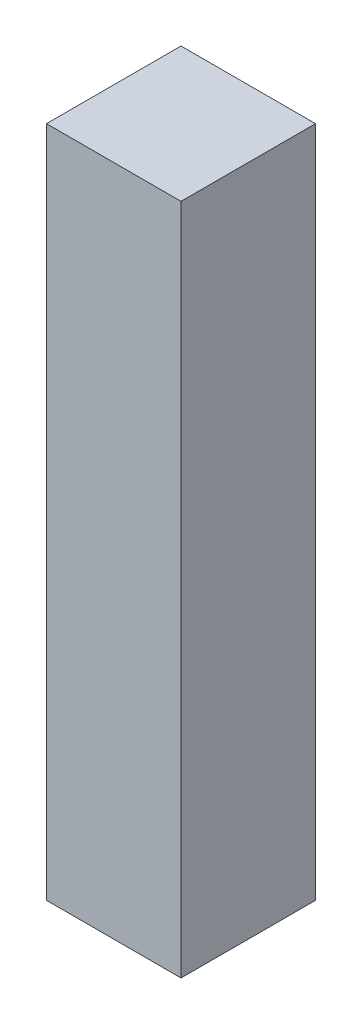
ISO-10303-21;
HEADER;
FILE_DESCRIPTION(('STEP AP214'),'2;1');
FILE_NAME('part.step','',(''),(''),'','','');
FILE_SCHEMA(('AUTOMOTIVE_DESIGN { 1 0 10303 214 1 1 1 1 }'));
ENDSEC;
DATA;
#1=APPLICATION_CONTEXT('core data for automotive mechanical design processes');
#2=APPLICATION_PROTOCOL_DEFINITION('international standard','automotive_design',2000,#1);
#3=PRODUCT_CONTEXT('',#1,'mechanical');
#4=PRODUCT('Part','Part','',(#3));
#5=PRODUCT_RELATED_PRODUCT_CATEGORY('part','',(#4));
#6=PRODUCT_DEFINITION_FORMATION('','',#4);
#7=PRODUCT_DEFINITION_CONTEXT('part definition',#1,'design');
#8=PRODUCT_DEFINITION('design','',#6,#7);
#9=PRODUCT_DEFINITION_SHAPE('','',#8);
#10=(LENGTH_UNIT() NAMED_UNIT(*) SI_UNIT(.MILLI.,.METRE.));
#11=(NAMED_UNIT(*) PLANE_ANGLE_UNIT() SI_UNIT($,.RADIAN.));
#12=(NAMED_UNIT(*) SI_UNIT($,.STERADIAN.) SOLID_ANGLE_UNIT());
#13=UNCERTAINTY_MEASURE_WITH_UNIT(LENGTH_MEASURE(1.E-05),#10,'distance_accuracy_value','');
#14=(GEOMETRIC_REPRESENTATION_CONTEXT(3) GLOBAL_UNCERTAINTY_ASSIGNED_CONTEXT((#13)) GLOBAL_UNIT_ASSIGNED_CONTEXT((#10,
#11,#12)) REPRESENTATION_CONTEXT('',''));
#15=CARTESIAN_POINT('',(0.,0.,0.));
#16=DIRECTION('',(0.,0.,1.));
#17=DIRECTION('',(1.,0.,0.));
#18=AXIS2_PLACEMENT_3D('',#15,#16,#17);
#19=CARTESIAN_POINT('',(100.,1000.,-100.));
#20=DIRECTION('',(-1.,0.,0.));
#21=DIRECTION('',(0.,0.,1.));
#22=AXIS2_PLACEMENT_3D('',#19,#20,#21);
#23=PLANE('',#22);
#24=DIRECTION('',(0.,0.,-1.));
#25=VECTOR('',#24,1.);
#26=CARTESIAN_POINT('',(100.,0.,-100.));
#27=LINE('',#26,#25);
#28=CARTESIAN_POINT('',(100.,0.,100.));
#29=VERTEX_POINT('',#28);
#30=CARTESIAN_POINT('',(100.,0.,-100.));
#31=VERTEX_POINT('',#30);
#32=EDGE_CURVE('E95',#29,#31,#27,.T.);
#33=ORIENTED_EDGE('',*,*,#32,.T.);
#34=DIRECTION('',(0.,-1.,0.));
#35=VECTOR('',#34,1.);
#36=CARTESIAN_POINT('',(100.,1000.,-100.));
#37=LINE('',#36,#35);
#38=CARTESIAN_POINT('',(100.,1000.,-100.));
#39=VERTEX_POINT('',#38);
#40=EDGE_CURVE('E11',#39,#31,#37,.T.);
#41=ORIENTED_EDGE('',*,*,#40,.F.);
#42=DIRECTION('',(0.,0.,-1.));
#43=VECTOR('',#42,1.);
#44=CARTESIAN_POINT('',(100.,1000.,-100.));
#45=LINE('',#44,#43);
#46=CARTESIAN_POINT('',(100.,1000.,100.));
#47=VERTEX_POINT('',#46);
#48=EDGE_CURVE('E83',#47,#39,#45,.T.);
#49=ORIENTED_EDGE('',*,*,#48,.F.);
#50=DIRECTION('',(0.,-1.,0.));
#51=VECTOR('',#50,1.);
#52=CARTESIAN_POINT('',(100.,1000.,100.));
#53=LINE('',#52,#51);
#54=EDGE_CURVE('E91',#47,#29,#53,.T.);
#55=ORIENTED_EDGE('',*,*,#54,.T.);
#56=EDGE_LOOP('',(#33,#41,#49,#55));
#57=FACE_BOUND('',#56,.T.);
#58=ADVANCED_FACE('F32',(#57),#23,.F.);
#59=CARTESIAN_POINT('',(-100.,1000.,-100.));
#60=DIRECTION('',(0.,0.,1.));
#61=DIRECTION('',(1.,0.,0.));
#62=AXIS2_PLACEMENT_3D('',#59,#60,#61);
#63=PLANE('',#62);
#64=DIRECTION('',(-1.,0.,0.));
#65=VECTOR('',#64,1.);
#66=CARTESIAN_POINT('',(-100.,0.,-100.));
#67=LINE('',#66,#65);
#68=CARTESIAN_POINT('',(-100.,0.,-100.));
#69=VERTEX_POINT('',#68);
#70=EDGE_CURVE('E87',#31,#69,#67,.T.);
#71=ORIENTED_EDGE('',*,*,#70,.T.);
#72=DIRECTION('',(0.,-1.,0.));
#73=VECTOR('',#72,1.);
#74=CARTESIAN_POINT('',(-100.,1000.,-100.));
#75=LINE('',#74,#73);
#76=CARTESIAN_POINT('',(-100.,1000.,-100.));
#77=VERTEX_POINT('',#76);
#78=EDGE_CURVE('E40',#77,#69,#75,.T.);
#79=ORIENTED_EDGE('',*,*,#78,.F.);
#80=DIRECTION('',(-1.,0.,0.));
#81=VECTOR('',#80,1.);
#82=CARTESIAN_POINT('',(-100.,1000.,-100.));
#83=LINE('',#82,#81);
#84=EDGE_CURVE('E78',#39,#77,#83,.T.);
#85=ORIENTED_EDGE('',*,*,#84,.F.);
#86=ORIENTED_EDGE('',*,*,#40,.T.);
#87=EDGE_LOOP('',(#71,#79,#85,#86));
#88=FACE_BOUND('',#87,.T.);
#89=ADVANCED_FACE('F86',(#88),#63,.F.);
#90=CARTESIAN_POINT('',(-100.,1000.,-100.));
#91=DIRECTION('',(1.,0.,0.));
#92=DIRECTION('',(0.,0.,-1.));
#93=AXIS2_PLACEMENT_3D('',#90,#91,#92);
#94=PLANE('',#93);
#95=DIRECTION('',(0.,0.,1.));
#96=VECTOR('',#95,1.);
#97=CARTESIAN_POINT('',(-100.,0.,-100.));
#98=LINE('',#97,#96);
#99=CARTESIAN_POINT('',(-100.,0.,100.));
#100=VERTEX_POINT('',#99);
#101=EDGE_CURVE('E65',#69,#100,#98,.T.);
#102=ORIENTED_EDGE('',*,*,#101,.T.);
#103=DIRECTION('',(0.,-1.,0.));
#104=VECTOR('',#103,1.);
#105=CARTESIAN_POINT('',(-100.,1000.,100.));
#106=LINE('',#105,#104);
#107=CARTESIAN_POINT('',(-100.,1000.,100.));
#108=VERTEX_POINT('',#107);
#109=EDGE_CURVE('E88',#108,#100,#106,.T.);
#110=ORIENTED_EDGE('',*,*,#109,.F.);
#111=DIRECTION('',(0.,0.,1.));
#112=VECTOR('',#111,1.);
#113=CARTESIAN_POINT('',(-100.,1000.,-100.));
#114=LINE('',#113,#112);
#115=EDGE_CURVE('E81',#77,#108,#114,.T.);
#116=ORIENTED_EDGE('',*,*,#115,.F.);
#117=ORIENTED_EDGE('',*,*,#78,.T.);
#118=EDGE_LOOP('',(#102,#110,#116,#117));
#119=FACE_BOUND('',#118,.T.);
#120=ADVANCED_FACE('F89',(#119),#94,.F.);
#121=CARTESIAN_POINT('',(-100.,1000.,100.));
#122=DIRECTION('',(0.,0.,-1.));
#123=DIRECTION('',(-1.,0.,0.));
#124=AXIS2_PLACEMENT_3D('',#121,#122,#123);
#125=PLANE('',#124);
#126=DIRECTION('',(1.,0.,0.));
#127=VECTOR('',#126,1.);
#128=CARTESIAN_POINT('',(-100.,0.,100.));
#129=LINE('',#128,#127);
#130=EDGE_CURVE('E71',#100,#29,#129,.T.);
#131=ORIENTED_EDGE('',*,*,#130,.T.);
#132=ORIENTED_EDGE('',*,*,#54,.F.);
#133=DIRECTION('',(1.,0.,0.));
#134=VECTOR('',#133,1.);
#135=CARTESIAN_POINT('',(-100.,1000.,100.));
#136=LINE('',#135,#134);
#137=EDGE_CURVE('E48',#108,#47,#136,.T.);
#138=ORIENTED_EDGE('',*,*,#137,.F.);
#139=ORIENTED_EDGE('',*,*,#109,.T.);
#140=EDGE_LOOP('',(#131,#132,#138,#139));
#141=FACE_BOUND('',#140,.T.);
#142=ADVANCED_FACE('F102',(#141),#125,.F.);
#143=CARTESIAN_POINT('',(0.,1000.,0.));
#144=DIRECTION('',(0.,1.,0.));
#145=DIRECTION('',(0.,0.,1.));
#146=AXIS2_PLACEMENT_3D('',#143,#144,#145);
#147=PLANE('',#146);
#148=ORIENTED_EDGE('',*,*,#48,.T.);
#149=ORIENTED_EDGE('',*,*,#84,.T.);
#150=ORIENTED_EDGE('',*,*,#115,.T.);
#151=ORIENTED_EDGE('',*,*,#137,.T.);
#152=EDGE_LOOP('',(#148,#149,#150,#151));
#153=FACE_BOUND('',#152,.T.);
#154=ADVANCED_FACE('F79',(#153),#147,.T.);
#155=CARTESIAN_POINT('',(0.,0.,0.));
#156=DIRECTION('',(0.,1.,0.));
#157=DIRECTION('',(0.,0.,1.));
#158=AXIS2_PLACEMENT_3D('',#155,#156,#157);
#159=PLANE('',#158);
#160=ORIENTED_EDGE('',*,*,#32,.F.);
#161=ORIENTED_EDGE('',*,*,#130,.F.);
#162=ORIENTED_EDGE('',*,*,#101,.F.);
#163=ORIENTED_EDGE('',*,*,#70,.F.);
#164=EDGE_LOOP('',(#160,#161,#162,#163));
#165=FACE_BOUND('',#164,.T.);
#166=ADVANCED_FACE('F105',(#165),#159,.F.);
#167=CLOSED_SHELL('',(#58,#89,#120,#142,#154,#166));
#168=MANIFOLD_SOLID_BREP('B2',#167);
#169=ADVANCED_BREP_SHAPE_REPRESENTATION('',(#18,#168),#14);
#170=SHAPE_DEFINITION_REPRESENTATION(#9,#169);
ENDSEC;
END-ISO-10303-21;
